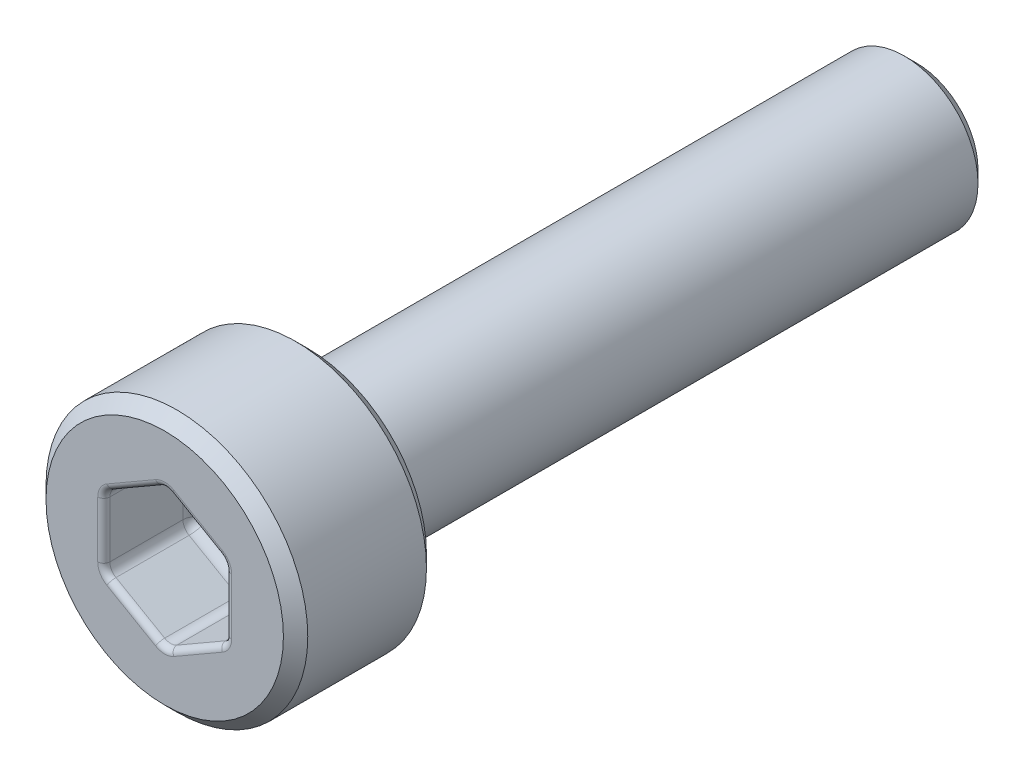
ISO-10303-21;
HEADER;
FILE_DESCRIPTION(('STEP AP214'),'2;1');
FILE_NAME('part.step','',(''),(''),'','','');
FILE_SCHEMA(('AUTOMOTIVE_DESIGN { 1 0 10303 214 1 1 1 1 }'));
ENDSEC;
DATA;
#1=APPLICATION_CONTEXT('core data for automotive mechanical design processes');
#2=APPLICATION_PROTOCOL_DEFINITION('international standard','automotive_design',2000,#1);
#3=PRODUCT_CONTEXT('',#1,'mechanical');
#4=PRODUCT('Part','Part','',(#3));
#5=PRODUCT_RELATED_PRODUCT_CATEGORY('part','',(#4));
#6=PRODUCT_DEFINITION_FORMATION('','',#4);
#7=PRODUCT_DEFINITION_CONTEXT('part definition',#1,'design');
#8=PRODUCT_DEFINITION('design','',#6,#7);
#9=PRODUCT_DEFINITION_SHAPE('','',#8);
#10=(LENGTH_UNIT() NAMED_UNIT(*) SI_UNIT(.MILLI.,.METRE.));
#11=(NAMED_UNIT(*) PLANE_ANGLE_UNIT() SI_UNIT($,.RADIAN.));
#12=(NAMED_UNIT(*) SI_UNIT($,.STERADIAN.) SOLID_ANGLE_UNIT());
#13=UNCERTAINTY_MEASURE_WITH_UNIT(LENGTH_MEASURE(1.E-05),#10,'distance_accuracy_value','');
#14=(GEOMETRIC_REPRESENTATION_CONTEXT(3) GLOBAL_UNCERTAINTY_ASSIGNED_CONTEXT((#13)) GLOBAL_UNIT_ASSIGNED_CONTEXT((#10,
#11,#12)) REPRESENTATION_CONTEXT('',''));
#15=CARTESIAN_POINT('',(0.,0.,0.));
#16=DIRECTION('',(0.,0.,1.));
#17=DIRECTION('',(1.,0.,0.));
#18=AXIS2_PLACEMENT_3D('',#15,#16,#17);
#19=CARTESIAN_POINT('',(0.,0.,2.35));
#20=DIRECTION('',(0.,0.,-1.));
#21=DIRECTION('',(-1.,0.,0.));
#22=AXIS2_PLACEMENT_3D('',#19,#20,#21);
#23=PLANE('',#22);
#24=DIRECTION('',(0.,1.,0.));
#25=VECTOR('',#24,1.);
#26=CARTESIAN_POINT('',(1.1,0.,2.35));
#27=LINE('',#26,#25);
#28=CARTESIAN_POINT('',(1.1,0.4618802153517,2.35));
#29=VERTEX_POINT('',#28);
#30=CARTESIAN_POINT('',(1.1,-0.461880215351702,2.35));
#31=VERTEX_POINT('',#30);
#32=EDGE_CURVE('E268',#29,#31,#27,.F.);
#33=ORIENTED_EDGE('',*,*,#32,.T.);
#34=CARTESIAN_POINT('',(0.8,-0.461880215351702,2.35));
#35=DIRECTION('',(0.,0.,-1.));
#36=DIRECTION('',(-1.,0.,0.));
#37=AXIS2_PLACEMENT_3D('',#34,#35,#36);
#38=CIRCLE('',#37,0.3);
#39=CARTESIAN_POINT('',(0.95,-0.721687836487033,2.35));
#40=VERTEX_POINT('',#39);
#41=EDGE_CURVE('E333',#31,#40,#38,.T.);
#42=ORIENTED_EDGE('',*,*,#41,.T.);
#43=DIRECTION('',(0.866025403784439,0.499999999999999,0.));
#44=VECTOR('',#43,1.);
#45=CARTESIAN_POINT('',(0.549999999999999,-0.952627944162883,2.35));
#46=LINE('',#45,#44);
#47=CARTESIAN_POINT('',(0.149999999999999,-1.18356805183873,2.35));
#48=VERTEX_POINT('',#47);
#49=EDGE_CURVE('E331',#40,#48,#46,.F.);
#50=ORIENTED_EDGE('',*,*,#49,.T.);
#51=CARTESIAN_POINT('',(0.,-0.923760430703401,2.35));
#52=DIRECTION('',(0.,0.,-1.));
#53=DIRECTION('',(-1.,0.,0.));
#54=AXIS2_PLACEMENT_3D('',#51,#52,#53);
#55=CIRCLE('',#54,0.3);
#56=CARTESIAN_POINT('',(-0.150000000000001,-1.18356805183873,2.35));
#57=VERTEX_POINT('',#56);
#58=EDGE_CURVE('E329',#48,#57,#55,.T.);
#59=ORIENTED_EDGE('',*,*,#58,.T.);
#60=DIRECTION('',(0.866025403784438,-0.500000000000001,0.));
#61=VECTOR('',#60,1.);
#62=CARTESIAN_POINT('',(-0.550000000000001,-0.952627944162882,2.35));
#63=LINE('',#62,#61);
#64=CARTESIAN_POINT('',(-0.950000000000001,-0.721687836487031,2.35));
#65=VERTEX_POINT('',#64);
#66=EDGE_CURVE('E327',#57,#65,#63,.F.);
#67=ORIENTED_EDGE('',*,*,#66,.T.);
#68=CARTESIAN_POINT('',(-0.800000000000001,-0.4618802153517,2.35));
#69=DIRECTION('',(0.,0.,-1.));
#70=DIRECTION('',(-1.,0.,0.));
#71=AXIS2_PLACEMENT_3D('',#68,#69,#70);
#72=CIRCLE('',#71,0.3);
#73=CARTESIAN_POINT('',(-1.1,-0.4618802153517,2.35));
#74=VERTEX_POINT('',#73);
#75=EDGE_CURVE('E325',#65,#74,#72,.T.);
#76=ORIENTED_EDGE('',*,*,#75,.T.);
#77=DIRECTION('',(0.,-1.,0.));
#78=VECTOR('',#77,1.);
#79=CARTESIAN_POINT('',(-1.1,0.,2.35));
#80=LINE('',#79,#78);
#81=CARTESIAN_POINT('',(-1.1,0.461880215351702,2.35));
#82=VERTEX_POINT('',#81);
#83=EDGE_CURVE('E323',#74,#82,#80,.F.);
#84=ORIENTED_EDGE('',*,*,#83,.T.);
#85=CARTESIAN_POINT('',(-0.8,0.461880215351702,2.35));
#86=DIRECTION('',(0.,0.,-1.));
#87=DIRECTION('',(-1.,0.,0.));
#88=AXIS2_PLACEMENT_3D('',#85,#86,#87);
#89=CIRCLE('',#88,0.3);
#90=CARTESIAN_POINT('',(-0.95,0.721687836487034,2.35));
#91=VERTEX_POINT('',#90);
#92=EDGE_CURVE('E321',#82,#91,#89,.T.);
#93=ORIENTED_EDGE('',*,*,#92,.T.);
#94=DIRECTION('',(-0.866025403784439,-0.499999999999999,0.));
#95=VECTOR('',#94,1.);
#96=CARTESIAN_POINT('',(-0.549999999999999,0.952627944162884,2.35));
#97=LINE('',#96,#95);
#98=CARTESIAN_POINT('',(-0.149999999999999,1.18356805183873,2.35));
#99=VERTEX_POINT('',#98);
#100=EDGE_CURVE('E319',#91,#99,#97,.F.);
#101=ORIENTED_EDGE('',*,*,#100,.T.);
#102=CARTESIAN_POINT('',(0.,0.923760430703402,2.35));
#103=DIRECTION('',(0.,0.,-1.));
#104=DIRECTION('',(-1.,0.,0.));
#105=AXIS2_PLACEMENT_3D('',#102,#103,#104);
#106=CIRCLE('',#105,0.3);
#107=CARTESIAN_POINT('',(0.150000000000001,1.18356805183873,2.35));
#108=VERTEX_POINT('',#107);
#109=EDGE_CURVE('E317',#99,#108,#106,.T.);
#110=ORIENTED_EDGE('',*,*,#109,.T.);
#111=DIRECTION('',(-0.866025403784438,0.500000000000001,0.));
#112=VECTOR('',#111,1.);
#113=CARTESIAN_POINT('',(0.550000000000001,0.952627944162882,2.35));
#114=LINE('',#113,#112);
#115=CARTESIAN_POINT('',(0.950000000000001,0.721687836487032,2.35));
#116=VERTEX_POINT('',#115);
#117=EDGE_CURVE('E315',#108,#116,#114,.F.);
#118=ORIENTED_EDGE('',*,*,#117,.T.);
#119=CARTESIAN_POINT('',(0.8,0.4618802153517,2.35));
#120=DIRECTION('',(0.,0.,-1.));
#121=DIRECTION('',(-1.,0.,0.));
#122=AXIS2_PLACEMENT_3D('',#119,#120,#121);
#123=CIRCLE('',#122,0.3);
#124=EDGE_CURVE('E313',#116,#29,#123,.T.);
#125=ORIENTED_EDGE('',*,*,#124,.T.);
#126=EDGE_LOOP('',(#33,#42,#50,#59,#67,#76,#84,#93,#101,#110,#118,#125));
#127=FACE_BOUND('',#126,.T.);
#128=CARTESIAN_POINT('',(0.,0.,2.35));
#129=DIRECTION('',(0.,0.,-1.));
#130=DIRECTION('',(-1.,0.,0.));
#131=AXIS2_PLACEMENT_3D('',#128,#129,#130);
#132=CIRCLE('',#131,1.94999999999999);
#133=CARTESIAN_POINT('',(-1.94999999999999,0.,2.35));
#134=VERTEX_POINT('',#133);
#135=EDGE_CURVE('E311',#134,#134,#132,.F.);
#136=ORIENTED_EDGE('',*,*,#135,.T.);
#137=EDGE_LOOP('',(#136));
#138=FACE_BOUND('',#137,.T.);
#139=ADVANCED_FACE('F39',(#127,#138),#23,.F.);
#140=CARTESIAN_POINT('',(0.,0.,21.9198795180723));
#141=DIRECTION('',(0.,0.,1.));
#142=DIRECTION('',(1.,0.,0.));
#143=AXIS2_PLACEMENT_3D('',#140,#141,#142);
#144=CYLINDRICAL_SURFACE('',#143,2.15);
#145=CARTESIAN_POINT('',(0.,0.,2.15));
#146=DIRECTION('',(0.,0.,-1.));
#147=DIRECTION('',(-1.,0.,0.));
#148=AXIS2_PLACEMENT_3D('',#145,#146,#147);
#149=CIRCLE('',#148,2.15);
#150=CARTESIAN_POINT('',(-2.15,0.,2.15));
#151=VERTEX_POINT('',#150);
#152=EDGE_CURVE('E873',#151,#151,#149,.T.);
#153=ORIENTED_EDGE('',*,*,#152,.T.);
#154=EDGE_LOOP('',(#153));
#155=FACE_BOUND('',#154,.T.);
#156=CARTESIAN_POINT('',(0.,0.,0.200000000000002));
#157=DIRECTION('',(0.,0.,1.));
#158=DIRECTION('',(1.,0.,0.));
#159=AXIS2_PLACEMENT_3D('',#156,#157,#158);
#160=CIRCLE('',#159,2.15);
#161=CARTESIAN_POINT('',(2.15,0.,0.200000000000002));
#162=VERTEX_POINT('',#161);
#163=EDGE_CURVE('E878',#162,#162,#160,.T.);
#164=ORIENTED_EDGE('',*,*,#163,.T.);
#165=EDGE_LOOP('',(#164));
#166=FACE_BOUND('',#165,.T.);
#167=ADVANCED_FACE('F432',(#155,#166),#144,.T.);
#168=CARTESIAN_POINT('',(0.,2.15,0.));
#169=DIRECTION('',(0.,0.,1.));
#170=DIRECTION('',(1.,0.,0.));
#171=AXIS2_PLACEMENT_3D('',#168,#169,#170);
#172=PLANE('',#171);
#173=CARTESIAN_POINT('',(0.,0.,0.));
#174=DIRECTION('',(0.,0.,1.));
#175=DIRECTION('',(1.,0.,0.));
#176=AXIS2_PLACEMENT_3D('',#173,#174,#175);
#177=CIRCLE('',#176,1.41);
#178=CARTESIAN_POINT('',(1.41,0.,0.));
#179=VERTEX_POINT('',#178);
#180=EDGE_CURVE('E263',#179,#179,#177,.T.);
#181=ORIENTED_EDGE('',*,*,#180,.T.);
#182=EDGE_LOOP('',(#181));
#183=FACE_BOUND('',#182,.T.);
#184=CARTESIAN_POINT('',(0.,0.,0.));
#185=DIRECTION('',(0.,0.,1.));
#186=DIRECTION('',(1.,0.,0.));
#187=AXIS2_PLACEMENT_3D('',#184,#185,#186);
#188=CIRCLE('',#187,1.95);
#189=CARTESIAN_POINT('',(1.95,0.,0.));
#190=VERTEX_POINT('',#189);
#191=EDGE_CURVE('E871',#190,#190,#188,.F.);
#192=ORIENTED_EDGE('',*,*,#191,.T.);
#193=EDGE_LOOP('',(#192));
#194=FACE_BOUND('',#193,.T.);
#195=ADVANCED_FACE('F438',(#183,#194),#172,.F.);
#196=CARTESIAN_POINT('',(0.,0.,21.9198795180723));
#197=DIRECTION('',(0.,0.,1.));
#198=DIRECTION('',(1.,0.,0.));
#199=AXIS2_PLACEMENT_3D('',#196,#197,#198);
#200=CYLINDRICAL_SURFACE('',#199,1.21);
#201=CARTESIAN_POINT('',(0.,0.,-0.200000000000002));
#202=DIRECTION('',(0.,0.,1.));
#203=DIRECTION('',(1.,0.,0.));
#204=AXIS2_PLACEMENT_3D('',#201,#202,#203);
#205=CIRCLE('',#204,1.21);
#206=CARTESIAN_POINT('',(1.21,0.,-0.200000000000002));
#207=VERTEX_POINT('',#206);
#208=EDGE_CURVE('E266',#207,#207,#205,.F.);
#209=ORIENTED_EDGE('',*,*,#208,.T.);
#210=EDGE_LOOP('',(#209));
#211=FACE_BOUND('',#210,.T.);
#212=CARTESIAN_POINT('',(0.,0.,-9.8));
#213=DIRECTION('',(0.,0.,1.));
#214=DIRECTION('',(1.,0.,0.));
#215=AXIS2_PLACEMENT_3D('',#212,#213,#214);
#216=CIRCLE('',#215,1.21);
#217=CARTESIAN_POINT('',(1.21,0.,-9.8));
#218=VERTEX_POINT('',#217);
#219=EDGE_CURVE('E872',#218,#218,#216,.T.);
#220=ORIENTED_EDGE('',*,*,#219,.T.);
#221=EDGE_LOOP('',(#220));
#222=FACE_BOUND('',#221,.T.);
#223=ADVANCED_FACE('F813',(#211,#222),#200,.T.);
#224=CARTESIAN_POINT('',(0.,1.21,-10.));
#225=DIRECTION('',(0.,0.,1.));
#226=DIRECTION('',(1.,0.,0.));
#227=AXIS2_PLACEMENT_3D('',#224,#225,#226);
#228=PLANE('',#227);
#229=CARTESIAN_POINT('',(0.,0.,-10.));
#230=DIRECTION('',(0.,0.,1.));
#231=DIRECTION('',(1.,0.,0.));
#232=AXIS2_PLACEMENT_3D('',#229,#230,#231);
#233=CIRCLE('',#232,1.01);
#234=CARTESIAN_POINT('',(1.01,0.,-10.));
#235=VERTEX_POINT('',#234);
#236=EDGE_CURVE('E213',#235,#235,#233,.F.);
#237=ORIENTED_EDGE('',*,*,#236,.T.);
#238=EDGE_LOOP('',(#237));
#239=FACE_BOUND('',#238,.T.);
#240=ADVANCED_FACE('F805',(#239),#228,.F.);
#241=CARTESIAN_POINT('',(0.,-1.15470053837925,0.849999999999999));
#242=DIRECTION('',(0.499999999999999,-0.866025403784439,0.));
#243=DIRECTION('',(0.866025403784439,0.499999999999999,0.));
#244=AXIS2_PLACEMENT_3D('',#241,#242,#243);
#245=PLANE('',#244);
#246=DIRECTION('',(0.,0.,1.));
#247=VECTOR('',#246,1.);
#248=CARTESIAN_POINT('',(0.0999999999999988,-1.09696551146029,2.35));
#249=LINE('',#248,#247);
#250=CARTESIAN_POINT('',(0.0999999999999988,-1.09696551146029,1.05));
#251=VERTEX_POINT('',#250);
#252=CARTESIAN_POINT('',(0.0999999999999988,-1.09696551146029,2.25));
#253=VERTEX_POINT('',#252);
#254=EDGE_CURVE('E260',#251,#253,#249,.T.);
#255=ORIENTED_EDGE('',*,*,#254,.T.);
#256=DIRECTION('',(0.866025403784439,0.499999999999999,0.));
#257=VECTOR('',#256,1.);
#258=CARTESIAN_POINT('',(0.,-1.15470053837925,2.25));
#259=LINE('',#258,#257);
#260=CARTESIAN_POINT('',(0.899999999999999,-0.635085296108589,2.25));
#261=VERTEX_POINT('',#260);
#262=EDGE_CURVE('E339',#253,#261,#259,.T.);
#263=ORIENTED_EDGE('',*,*,#262,.T.);
#264=DIRECTION('',(0.,0.,1.));
#265=VECTOR('',#264,1.);
#266=CARTESIAN_POINT('',(0.899999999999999,-0.635085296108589,0.849999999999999));
#267=LINE('',#266,#265);
#268=CARTESIAN_POINT('',(0.899999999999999,-0.635085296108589,1.05));
#269=VERTEX_POINT('',#268);
#270=EDGE_CURVE('E256',#261,#269,#267,.F.);
#271=ORIENTED_EDGE('',*,*,#270,.T.);
#272=DIRECTION('',(0.866025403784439,0.499999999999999,0.));
#273=VECTOR('',#272,1.);
#274=CARTESIAN_POINT('',(0.,-1.15470053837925,1.05));
#275=LINE('',#274,#273);
#276=EDGE_CURVE('E258',#269,#251,#275,.F.);
#277=ORIENTED_EDGE('',*,*,#276,.T.);
#278=EDGE_LOOP('',(#255,#263,#271,#277));
#279=FACE_BOUND('',#278,.T.);
#280=ADVANCED_FACE('F796',(#279),#245,.F.);
#281=CARTESIAN_POINT('',(-1.,-0.577350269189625,0.849999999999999));
#282=DIRECTION('',(-0.500000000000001,-0.866025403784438,0.));
#283=DIRECTION('',(0.866025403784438,-0.500000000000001,0.));
#284=AXIS2_PLACEMENT_3D('',#281,#282,#283);
#285=PLANE('',#284);
#286=DIRECTION('',(0.,0.,1.));
#287=VECTOR('',#286,1.);
#288=CARTESIAN_POINT('',(-0.900000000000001,-0.635085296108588,2.35));
#289=LINE('',#288,#287);
#290=CARTESIAN_POINT('',(-0.900000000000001,-0.635085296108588,1.05));
#291=VERTEX_POINT('',#290);
#292=CARTESIAN_POINT('',(-0.900000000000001,-0.635085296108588,2.25));
#293=VERTEX_POINT('',#292);
#294=EDGE_CURVE('E227',#291,#293,#289,.T.);
#295=ORIENTED_EDGE('',*,*,#294,.T.);
#296=DIRECTION('',(0.866025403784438,-0.500000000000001,0.));
#297=VECTOR('',#296,1.);
#298=CARTESIAN_POINT('',(-1.,-0.577350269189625,2.25));
#299=LINE('',#298,#297);
#300=CARTESIAN_POINT('',(-0.100000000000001,-1.09696551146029,2.25));
#301=VERTEX_POINT('',#300);
#302=EDGE_CURVE('E343',#293,#301,#299,.T.);
#303=ORIENTED_EDGE('',*,*,#302,.T.);
#304=DIRECTION('',(0.,0.,1.));
#305=VECTOR('',#304,1.);
#306=CARTESIAN_POINT('',(-0.100000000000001,-1.09696551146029,0.849999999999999));
#307=LINE('',#306,#305);
#308=CARTESIAN_POINT('',(-0.100000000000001,-1.09696551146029,1.05));
#309=VERTEX_POINT('',#308);
#310=EDGE_CURVE('E219',#301,#309,#307,.F.);
#311=ORIENTED_EDGE('',*,*,#310,.T.);
#312=DIRECTION('',(0.866025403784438,-0.500000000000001,0.));
#313=VECTOR('',#312,1.);
#314=CARTESIAN_POINT('',(-1.,-0.577350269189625,1.05));
#315=LINE('',#314,#313);
#316=EDGE_CURVE('E190',#309,#291,#315,.F.);
#317=ORIENTED_EDGE('',*,*,#316,.T.);
#318=EDGE_LOOP('',(#295,#303,#311,#317));
#319=FACE_BOUND('',#318,.T.);
#320=ADVANCED_FACE('F788',(#319),#285,.F.);
#321=CARTESIAN_POINT('',(-1.,0.577350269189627,0.849999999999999));
#322=DIRECTION('',(-1.,0.,0.));
#323=DIRECTION('',(0.,-1.,0.));
#324=AXIS2_PLACEMENT_3D('',#321,#322,#323);
#325=PLANE('',#324);
#326=DIRECTION('',(0.,0.,1.));
#327=VECTOR('',#326,1.);
#328=CARTESIAN_POINT('',(-1.,0.461880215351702,2.35));
#329=LINE('',#328,#327);
#330=CARTESIAN_POINT('',(-1.,0.461880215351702,1.05));
#331=VERTEX_POINT('',#330);
#332=CARTESIAN_POINT('',(-1.,0.461880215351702,2.25));
#333=VERTEX_POINT('',#332);
#334=EDGE_CURVE('E230',#331,#333,#329,.T.);
#335=ORIENTED_EDGE('',*,*,#334,.T.);
#336=DIRECTION('',(0.,-1.,0.));
#337=VECTOR('',#336,1.);
#338=CARTESIAN_POINT('',(-1.,0.577350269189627,2.25));
#339=LINE('',#338,#337);
#340=CARTESIAN_POINT('',(-1.,-0.4618802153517,2.25));
#341=VERTEX_POINT('',#340);
#342=EDGE_CURVE('E347',#333,#341,#339,.T.);
#343=ORIENTED_EDGE('',*,*,#342,.T.);
#344=DIRECTION('',(0.,0.,1.));
#345=VECTOR('',#344,1.);
#346=CARTESIAN_POINT('',(-1.,-0.4618802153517,0.849999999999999));
#347=LINE('',#346,#345);
#348=CARTESIAN_POINT('',(-1.,-0.4618802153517,1.05));
#349=VERTEX_POINT('',#348);
#350=EDGE_CURVE('E235',#341,#349,#347,.F.);
#351=ORIENTED_EDGE('',*,*,#350,.T.);
#352=DIRECTION('',(0.,-1.,0.));
#353=VECTOR('',#352,1.);
#354=CARTESIAN_POINT('',(-1.,0.577350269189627,1.05));
#355=LINE('',#354,#353);
#356=EDGE_CURVE('E233',#349,#331,#355,.F.);
#357=ORIENTED_EDGE('',*,*,#356,.T.);
#358=EDGE_LOOP('',(#335,#343,#351,#357));
#359=FACE_BOUND('',#358,.T.);
#360=ADVANCED_FACE('F407',(#359),#325,.F.);
#361=CARTESIAN_POINT('',(0.,1.15470053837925,0.849999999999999));
#362=DIRECTION('',(-0.499999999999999,0.866025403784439,0.));
#363=DIRECTION('',(-0.866025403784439,-0.499999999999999,0.));
#364=AXIS2_PLACEMENT_3D('',#361,#362,#363);
#365=PLANE('',#364);
#366=DIRECTION('',(0.,0.,1.));
#367=VECTOR('',#366,1.);
#368=CARTESIAN_POINT('',(-0.0999999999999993,1.09696551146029,2.35));
#369=LINE('',#368,#367);
#370=CARTESIAN_POINT('',(-0.0999999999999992,1.09696551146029,1.05));
#371=VERTEX_POINT('',#370);
#372=CARTESIAN_POINT('',(-0.0999999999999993,1.09696551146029,2.25));
#373=VERTEX_POINT('',#372);
#374=EDGE_CURVE('E241',#371,#373,#369,.T.);
#375=ORIENTED_EDGE('',*,*,#374,.T.);
#376=DIRECTION('',(-0.866025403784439,-0.499999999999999,0.));
#377=VECTOR('',#376,1.);
#378=CARTESIAN_POINT('',(0.,1.15470053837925,2.25));
#379=LINE('',#378,#377);
#380=CARTESIAN_POINT('',(-0.9,0.63508529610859,2.25));
#381=VERTEX_POINT('',#380);
#382=EDGE_CURVE('E351',#373,#381,#379,.T.);
#383=ORIENTED_EDGE('',*,*,#382,.T.);
#384=DIRECTION('',(0.,0.,1.));
#385=VECTOR('',#384,1.);
#386=CARTESIAN_POINT('',(-0.9,0.63508529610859,0.849999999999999));
#387=LINE('',#386,#385);
#388=CARTESIAN_POINT('',(-0.9,0.63508529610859,1.05));
#389=VERTEX_POINT('',#388);
#390=EDGE_CURVE('E237',#381,#389,#387,.F.);
#391=ORIENTED_EDGE('',*,*,#390,.T.);
#392=DIRECTION('',(-0.866025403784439,-0.499999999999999,0.));
#393=VECTOR('',#392,1.);
#394=CARTESIAN_POINT('',(0.,1.15470053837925,1.05));
#395=LINE('',#394,#393);
#396=EDGE_CURVE('E239',#389,#371,#395,.F.);
#397=ORIENTED_EDGE('',*,*,#396,.T.);
#398=EDGE_LOOP('',(#375,#383,#391,#397));
#399=FACE_BOUND('',#398,.T.);
#400=ADVANCED_FACE('F771',(#399),#365,.F.);
#401=CARTESIAN_POINT('',(1.,0.577350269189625,0.849999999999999));
#402=DIRECTION('',(0.500000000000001,0.866025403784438,0.));
#403=DIRECTION('',(-0.866025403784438,0.500000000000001,0.));
#404=AXIS2_PLACEMENT_3D('',#401,#402,#403);
#405=PLANE('',#404);
#406=DIRECTION('',(0.,0.,1.));
#407=VECTOR('',#406,1.);
#408=CARTESIAN_POINT('',(0.9,0.635085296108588,2.35));
#409=LINE('',#408,#407);
#410=CARTESIAN_POINT('',(0.9,0.635085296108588,1.05));
#411=VERTEX_POINT('',#410);
#412=CARTESIAN_POINT('',(0.9,0.635085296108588,2.25));
#413=VERTEX_POINT('',#412);
#414=EDGE_CURVE('E248',#411,#413,#409,.T.);
#415=ORIENTED_EDGE('',*,*,#414,.T.);
#416=DIRECTION('',(-0.866025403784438,0.500000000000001,0.));
#417=VECTOR('',#416,1.);
#418=CARTESIAN_POINT('',(1.,0.577350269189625,2.25));
#419=LINE('',#418,#417);
#420=CARTESIAN_POINT('',(0.100000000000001,1.09696551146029,2.25));
#421=VERTEX_POINT('',#420);
#422=EDGE_CURVE('E355',#413,#421,#419,.T.);
#423=ORIENTED_EDGE('',*,*,#422,.T.);
#424=DIRECTION('',(0.,0.,1.));
#425=VECTOR('',#424,1.);
#426=CARTESIAN_POINT('',(0.100000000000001,1.09696551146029,0.849999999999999));
#427=LINE('',#426,#425);
#428=CARTESIAN_POINT('',(0.100000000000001,1.09696551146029,1.05));
#429=VERTEX_POINT('',#428);
#430=EDGE_CURVE('E244',#421,#429,#427,.F.);
#431=ORIENTED_EDGE('',*,*,#430,.T.);
#432=DIRECTION('',(-0.866025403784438,0.500000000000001,0.));
#433=VECTOR('',#432,1.);
#434=CARTESIAN_POINT('',(1.,0.577350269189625,1.05));
#435=LINE('',#434,#433);
#436=EDGE_CURVE('E246',#429,#411,#435,.F.);
#437=ORIENTED_EDGE('',*,*,#436,.T.);
#438=EDGE_LOOP('',(#415,#423,#431,#437));
#439=FACE_BOUND('',#438,.T.);
#440=ADVANCED_FACE('F763',(#439),#405,.F.);
#441=CARTESIAN_POINT('',(1.,-0.577350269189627,0.849999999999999));
#442=DIRECTION('',(1.,0.,0.));
#443=DIRECTION('',(0.,1.,0.));
#444=AXIS2_PLACEMENT_3D('',#441,#442,#443);
#445=PLANE('',#444);
#446=DIRECTION('',(0.,0.,1.));
#447=VECTOR('',#446,1.);
#448=CARTESIAN_POINT('',(1.,-0.461880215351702,2.35));
#449=LINE('',#448,#447);
#450=CARTESIAN_POINT('',(1.,-0.461880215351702,1.05));
#451=VERTEX_POINT('',#450);
#452=CARTESIAN_POINT('',(1.,-0.461880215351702,2.25));
#453=VERTEX_POINT('',#452);
#454=EDGE_CURVE('E254',#451,#453,#449,.T.);
#455=ORIENTED_EDGE('',*,*,#454,.T.);
#456=DIRECTION('',(0.,1.,0.));
#457=VECTOR('',#456,1.);
#458=CARTESIAN_POINT('',(1.,-0.577350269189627,2.25));
#459=LINE('',#458,#457);
#460=CARTESIAN_POINT('',(1.,0.4618802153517,2.25));
#461=VERTEX_POINT('',#460);
#462=EDGE_CURVE('E11',#453,#461,#459,.T.);
#463=ORIENTED_EDGE('',*,*,#462,.T.);
#464=DIRECTION('',(0.,0.,1.));
#465=VECTOR('',#464,1.);
#466=CARTESIAN_POINT('',(1.,0.4618802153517,0.849999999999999));
#467=LINE('',#466,#465);
#468=CARTESIAN_POINT('',(1.,0.4618802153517,1.05));
#469=VERTEX_POINT('',#468);
#470=EDGE_CURVE('E250',#461,#469,#467,.F.);
#471=ORIENTED_EDGE('',*,*,#470,.T.);
#472=DIRECTION('',(0.,1.,0.));
#473=VECTOR('',#472,1.);
#474=CARTESIAN_POINT('',(1.,-0.577350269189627,1.05));
#475=LINE('',#474,#473);
#476=EDGE_CURVE('E252',#469,#451,#475,.F.);
#477=ORIENTED_EDGE('',*,*,#476,.T.);
#478=EDGE_LOOP('',(#455,#463,#471,#477));
#479=FACE_BOUND('',#478,.T.);
#480=ADVANCED_FACE('F755',(#479),#445,.F.);
#481=CARTESIAN_POINT('',(0.,0.,0.849999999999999));
#482=DIRECTION('',(0.,0.,1.));
#483=DIRECTION('',(1.,0.,0.));
#484=AXIS2_PLACEMENT_3D('',#481,#482,#483);
#485=PLANE('',#484);
#486=DIRECTION('',(0.,-1.,0.));
#487=VECTOR('',#486,1.);
#488=CARTESIAN_POINT('',(-0.8,0.,0.849999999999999));
#489=LINE('',#488,#487);
#490=CARTESIAN_POINT('',(-0.8,0.461880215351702,0.849999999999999));
#491=VERTEX_POINT('',#490);
#492=CARTESIAN_POINT('',(-0.800000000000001,-0.4618802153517,0.849999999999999));
#493=VERTEX_POINT('',#492);
#494=EDGE_CURVE('E217',#491,#493,#489,.T.);
#495=ORIENTED_EDGE('',*,*,#494,.T.);
#496=DIRECTION('',(0.866025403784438,-0.500000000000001,0.));
#497=VECTOR('',#496,1.);
#498=CARTESIAN_POINT('',(-0.400000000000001,-0.692820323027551,0.849999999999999));
#499=LINE('',#498,#497);
#500=CARTESIAN_POINT('',(0.,-0.923760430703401,0.849999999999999));
#501=VERTEX_POINT('',#500);
#502=EDGE_CURVE('E188',#493,#501,#499,.T.);
#503=ORIENTED_EDGE('',*,*,#502,.T.);
#504=DIRECTION('',(0.866025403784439,0.499999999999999,0.));
#505=VECTOR('',#504,1.);
#506=CARTESIAN_POINT('',(0.399999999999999,-0.692820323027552,0.849999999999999));
#507=LINE('',#506,#505);
#508=CARTESIAN_POINT('',(0.8,-0.461880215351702,0.849999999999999));
#509=VERTEX_POINT('',#508);
#510=EDGE_CURVE('E206',#501,#509,#507,.T.);
#511=ORIENTED_EDGE('',*,*,#510,.T.);
#512=DIRECTION('',(0.,1.,0.));
#513=VECTOR('',#512,1.);
#514=CARTESIAN_POINT('',(0.8,0.,0.849999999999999));
#515=LINE('',#514,#513);
#516=CARTESIAN_POINT('',(0.8,0.4618802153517,0.849999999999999));
#517=VERTEX_POINT('',#516);
#518=EDGE_CURVE('E212',#509,#517,#515,.T.);
#519=ORIENTED_EDGE('',*,*,#518,.T.);
#520=DIRECTION('',(-0.866025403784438,0.500000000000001,0.));
#521=VECTOR('',#520,1.);
#522=CARTESIAN_POINT('',(0.400000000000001,0.692820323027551,0.849999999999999));
#523=LINE('',#522,#521);
#524=CARTESIAN_POINT('',(0.,0.923760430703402,0.849999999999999));
#525=VERTEX_POINT('',#524);
#526=EDGE_CURVE('E885',#517,#525,#523,.T.);
#527=ORIENTED_EDGE('',*,*,#526,.T.);
#528=DIRECTION('',(-0.866025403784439,-0.499999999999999,0.));
#529=VECTOR('',#528,1.);
#530=CARTESIAN_POINT('',(-0.4,0.692820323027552,0.849999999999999));
#531=LINE('',#530,#529);
#532=EDGE_CURVE('E222',#525,#491,#531,.T.);
#533=ORIENTED_EDGE('',*,*,#532,.T.);
#534=EDGE_LOOP('',(#495,#503,#511,#519,#527,#533));
#535=FACE_BOUND('',#534,.T.);
#536=ADVANCED_FACE('F215',(#535),#485,.T.);
#537=CARTESIAN_POINT('',(0.,0.,2.35));
#538=DIRECTION('',(0.,0.,-1.));
#539=DIRECTION('',(-1.,0.,0.));
#540=AXIS2_PLACEMENT_3D('',#537,#538,#539);
#541=CONICAL_SURFACE('',#540,1.95,0.785398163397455);
#542=ORIENTED_EDGE('',*,*,#152,.F.);
#543=EDGE_LOOP('',(#542));
#544=FACE_BOUND('',#543,.T.);
#545=ORIENTED_EDGE('',*,*,#135,.F.);
#546=EDGE_LOOP('',(#545));
#547=FACE_BOUND('',#546,.T.);
#548=ADVANCED_FACE('F444',(#544,#547),#541,.T.);
#549=CARTESIAN_POINT('',(0.,0.,0.200000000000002));
#550=DIRECTION('',(0.,0.,1.));
#551=DIRECTION('',(1.,0.,0.));
#552=AXIS2_PLACEMENT_3D('',#549,#550,#551);
#553=CONICAL_SURFACE('',#552,2.15,0.78539816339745);
#554=ORIENTED_EDGE('',*,*,#191,.F.);
#555=EDGE_LOOP('',(#554));
#556=FACE_BOUND('',#555,.T.);
#557=ORIENTED_EDGE('',*,*,#163,.F.);
#558=EDGE_LOOP('',(#557));
#559=FACE_BOUND('',#558,.T.);
#560=ADVANCED_FACE('F447',(#556,#559),#553,.T.);
#561=CARTESIAN_POINT('',(0.,0.,-9.8));
#562=DIRECTION('',(0.,0.,1.));
#563=DIRECTION('',(1.,0.,0.));
#564=AXIS2_PLACEMENT_3D('',#561,#562,#563);
#565=CONICAL_SURFACE('',#564,1.21,0.785398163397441);
#566=ORIENTED_EDGE('',*,*,#236,.F.);
#567=EDGE_LOOP('',(#566));
#568=FACE_BOUND('',#567,.T.);
#569=ORIENTED_EDGE('',*,*,#219,.F.);
#570=EDGE_LOOP('',(#569));
#571=FACE_BOUND('',#570,.T.);
#572=ADVANCED_FACE('F451',(#568,#571),#565,.T.);
#573=CARTESIAN_POINT('',(0.,0.923760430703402,0.849999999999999));
#574=DIRECTION('',(0.,0.,-1.));
#575=DIRECTION('',(-1.,0.,0.));
#576=AXIS2_PLACEMENT_3D('',#573,#574,#575);
#577=CYLINDRICAL_SURFACE('',#576,0.2);
#578=ORIENTED_EDGE('',*,*,#430,.F.);
#579=CARTESIAN_POINT('',(0.,0.923760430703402,2.25));
#580=DIRECTION('',(0.,0.,-1.));
#581=DIRECTION('',(-1.,0.,0.));
#582=AXIS2_PLACEMENT_3D('',#579,#580,#581);
#583=CIRCLE('',#582,0.2);
#584=EDGE_CURVE('E353',#421,#373,#583,.F.);
#585=ORIENTED_EDGE('',*,*,#584,.T.);
#586=ORIENTED_EDGE('',*,*,#374,.F.);
#587=CARTESIAN_POINT('',(0.,0.923760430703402,1.05));
#588=DIRECTION('',(0.,0.,1.));
#589=DIRECTION('',(1.,0.,0.));
#590=AXIS2_PLACEMENT_3D('',#587,#588,#589);
#591=CIRCLE('',#590,0.2);
#592=EDGE_CURVE('E308',#429,#371,#591,.T.);
#593=ORIENTED_EDGE('',*,*,#592,.F.);
#594=EDGE_LOOP('',(#578,#585,#586,#593));
#595=FACE_BOUND('',#594,.T.);
#596=ADVANCED_FACE('F455',(#595),#577,.F.);
#597=CARTESIAN_POINT('',(0.400000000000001,0.692820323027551,1.05));
#598=DIRECTION('',(-0.866025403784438,0.500000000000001,0.));
#599=DIRECTION('',(-0.500000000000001,-0.866025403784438,0.));
#600=AXIS2_PLACEMENT_3D('',#597,#598,#599);
#601=CYLINDRICAL_SURFACE('',#600,0.2);
#602=CARTESIAN_POINT('',(0.8,0.4618802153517,1.05));
#603=DIRECTION('',(-0.866025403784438,0.500000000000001,0.));
#604=DIRECTION('',(-0.500000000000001,-0.866025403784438,0.));
#605=AXIS2_PLACEMENT_3D('',#602,#603,#604);
#606=CIRCLE('',#605,0.2);
#607=EDGE_CURVE('E302',#411,#517,#606,.T.);
#608=ORIENTED_EDGE('',*,*,#607,.F.);
#609=ORIENTED_EDGE('',*,*,#436,.F.);
#610=CARTESIAN_POINT('',(0.,0.923760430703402,1.05));
#611=DIRECTION('',(0.866025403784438,-0.500000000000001,0.));
#612=DIRECTION('',(0.500000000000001,0.866025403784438,0.));
#613=AXIS2_PLACEMENT_3D('',#610,#611,#612);
#614=CIRCLE('',#613,0.2);
#615=EDGE_CURVE('E305',#525,#429,#614,.T.);
#616=ORIENTED_EDGE('',*,*,#615,.F.);
#617=ORIENTED_EDGE('',*,*,#526,.F.);
#618=EDGE_LOOP('',(#608,#609,#616,#617));
#619=FACE_BOUND('',#618,.T.);
#620=ADVANCED_FACE('F716',(#619),#601,.F.);
#621=CARTESIAN_POINT('',(0.8,0.4618802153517,0.849999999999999));
#622=DIRECTION('',(0.,0.,-1.));
#623=DIRECTION('',(-1.,0.,0.));
#624=AXIS2_PLACEMENT_3D('',#621,#622,#623);
#625=CYLINDRICAL_SURFACE('',#624,0.2);
#626=ORIENTED_EDGE('',*,*,#470,.F.);
#627=CARTESIAN_POINT('',(0.8,0.4618802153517,2.25));
#628=DIRECTION('',(0.,0.,-1.));
#629=DIRECTION('',(-1.,0.,0.));
#630=AXIS2_PLACEMENT_3D('',#627,#628,#629);
#631=CIRCLE('',#630,0.2);
#632=EDGE_CURVE('E48',#461,#413,#631,.F.);
#633=ORIENTED_EDGE('',*,*,#632,.T.);
#634=ORIENTED_EDGE('',*,*,#414,.F.);
#635=CARTESIAN_POINT('',(0.8,0.4618802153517,1.05));
#636=DIRECTION('',(0.,0.,1.));
#637=DIRECTION('',(1.,0.,0.));
#638=AXIS2_PLACEMENT_3D('',#635,#636,#637);
#639=CIRCLE('',#638,0.2);
#640=EDGE_CURVE('E299',#469,#411,#639,.T.);
#641=ORIENTED_EDGE('',*,*,#640,.F.);
#642=EDGE_LOOP('',(#626,#633,#634,#641));
#643=FACE_BOUND('',#642,.T.);
#644=ADVANCED_FACE('F707',(#643),#625,.F.);
#645=CARTESIAN_POINT('',(0.,0.923760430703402,1.05));
#646=DIRECTION('',(0.,0.,1.));
#647=DIRECTION('',(1.,0.,0.));
#648=AXIS2_PLACEMENT_3D('',#645,#646,#647);
#649=SPHERICAL_SURFACE('',#648,0.2);
#650=ORIENTED_EDGE('',*,*,#615,.T.);
#651=ORIENTED_EDGE('',*,*,#592,.T.);
#652=CARTESIAN_POINT('',(0.,0.923760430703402,1.05));
#653=DIRECTION('',(-0.866025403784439,-0.499999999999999,0.));
#654=DIRECTION('',(0.499999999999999,-0.866025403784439,0.));
#655=AXIS2_PLACEMENT_3D('',#652,#653,#654);
#656=CIRCLE('',#655,0.2);
#657=EDGE_CURVE('E296',#525,#371,#656,.F.);
#658=ORIENTED_EDGE('',*,*,#657,.F.);
#659=EDGE_LOOP('',(#650,#651,#658));
#660=FACE_BOUND('',#659,.T.);
#661=ADVANCED_FACE('F698',(#660),#649,.F.);
#662=CARTESIAN_POINT('',(0.8,0.4618802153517,1.05));
#663=DIRECTION('',(0.,0.,1.));
#664=DIRECTION('',(1.,0.,0.));
#665=AXIS2_PLACEMENT_3D('',#662,#663,#664);
#666=SPHERICAL_SURFACE('',#665,0.2);
#667=ORIENTED_EDGE('',*,*,#640,.T.);
#668=ORIENTED_EDGE('',*,*,#607,.T.);
#669=CARTESIAN_POINT('',(0.8,0.4618802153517,1.05));
#670=DIRECTION('',(0.,-1.,0.));
#671=DIRECTION('',(1.,0.,0.));
#672=AXIS2_PLACEMENT_3D('',#669,#670,#671);
#673=CIRCLE('',#672,0.2);
#674=EDGE_CURVE('E293',#469,#517,#673,.F.);
#675=ORIENTED_EDGE('',*,*,#674,.F.);
#676=EDGE_LOOP('',(#667,#668,#675));
#677=FACE_BOUND('',#676,.T.);
#678=ADVANCED_FACE('F690',(#677),#666,.F.);
#679=CARTESIAN_POINT('',(-0.8,0.461880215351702,0.849999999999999));
#680=DIRECTION('',(0.,0.,-1.));
#681=DIRECTION('',(-1.,0.,0.));
#682=AXIS2_PLACEMENT_3D('',#679,#680,#681);
#683=CYLINDRICAL_SURFACE('',#682,0.2);
#684=ORIENTED_EDGE('',*,*,#390,.F.);
#685=CARTESIAN_POINT('',(-0.8,0.461880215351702,2.25));
#686=DIRECTION('',(0.,0.,-1.));
#687=DIRECTION('',(-1.,0.,0.));
#688=AXIS2_PLACEMENT_3D('',#685,#686,#687);
#689=CIRCLE('',#688,0.2);
#690=EDGE_CURVE('E349',#381,#333,#689,.F.);
#691=ORIENTED_EDGE('',*,*,#690,.T.);
#692=ORIENTED_EDGE('',*,*,#334,.F.);
#693=CARTESIAN_POINT('',(-0.8,0.461880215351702,1.05));
#694=DIRECTION('',(0.,0.,1.));
#695=DIRECTION('',(1.,0.,0.));
#696=AXIS2_PLACEMENT_3D('',#693,#694,#695);
#697=CIRCLE('',#696,0.2);
#698=EDGE_CURVE('E290',#389,#331,#697,.T.);
#699=ORIENTED_EDGE('',*,*,#698,.F.);
#700=EDGE_LOOP('',(#684,#691,#692,#699));
#701=FACE_BOUND('',#700,.T.);
#702=ADVANCED_FACE('F404',(#701),#683,.F.);
#703=CARTESIAN_POINT('',(-0.4,0.692820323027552,1.05));
#704=DIRECTION('',(-0.866025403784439,-0.499999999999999,0.));
#705=DIRECTION('',(0.499999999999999,-0.866025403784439,0.));
#706=AXIS2_PLACEMENT_3D('',#703,#704,#705);
#707=CYLINDRICAL_SURFACE('',#706,0.2);
#708=ORIENTED_EDGE('',*,*,#657,.T.);
#709=ORIENTED_EDGE('',*,*,#396,.F.);
#710=CARTESIAN_POINT('',(-0.8,0.461880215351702,1.05));
#711=DIRECTION('',(0.866025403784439,0.499999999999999,0.));
#712=DIRECTION('',(-0.499999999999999,0.866025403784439,0.));
#713=AXIS2_PLACEMENT_3D('',#710,#711,#712);
#714=CIRCLE('',#713,0.2);
#715=EDGE_CURVE('E287',#491,#389,#714,.T.);
#716=ORIENTED_EDGE('',*,*,#715,.F.);
#717=ORIENTED_EDGE('',*,*,#532,.F.);
#718=EDGE_LOOP('',(#708,#709,#716,#717));
#719=FACE_BOUND('',#718,.T.);
#720=ADVANCED_FACE('F673',(#719),#707,.F.);
#721=CARTESIAN_POINT('',(0.8,0.,1.05));
#722=DIRECTION('',(0.,1.,0.));
#723=DIRECTION('',(-1.,0.,0.));
#724=AXIS2_PLACEMENT_3D('',#721,#722,#723);
#725=CYLINDRICAL_SURFACE('',#724,0.2);
#726=ORIENTED_EDGE('',*,*,#674,.T.);
#727=ORIENTED_EDGE('',*,*,#518,.F.);
#728=CARTESIAN_POINT('',(0.8,-0.461880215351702,1.05));
#729=DIRECTION('',(0.,1.,0.));
#730=DIRECTION('',(-1.,0.,0.));
#731=AXIS2_PLACEMENT_3D('',#728,#729,#730);
#732=CIRCLE('',#731,0.2);
#733=EDGE_CURVE('E284',#451,#509,#732,.T.);
#734=ORIENTED_EDGE('',*,*,#733,.F.);
#735=ORIENTED_EDGE('',*,*,#476,.F.);
#736=EDGE_LOOP('',(#726,#727,#734,#735));
#737=FACE_BOUND('',#736,.T.);
#738=ADVANCED_FACE('F664',(#737),#725,.F.);
#739=CARTESIAN_POINT('',(0.8,-0.461880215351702,0.849999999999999));
#740=DIRECTION('',(0.,0.,-1.));
#741=DIRECTION('',(-1.,0.,0.));
#742=AXIS2_PLACEMENT_3D('',#739,#740,#741);
#743=CYLINDRICAL_SURFACE('',#742,0.2);
#744=ORIENTED_EDGE('',*,*,#270,.F.);
#745=CARTESIAN_POINT('',(0.8,-0.461880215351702,2.25));
#746=DIRECTION('',(0.,0.,-1.));
#747=DIRECTION('',(-1.,0.,0.));
#748=AXIS2_PLACEMENT_3D('',#745,#746,#747);
#749=CIRCLE('',#748,0.2);
#750=EDGE_CURVE('E336',#261,#453,#749,.F.);
#751=ORIENTED_EDGE('',*,*,#750,.T.);
#752=ORIENTED_EDGE('',*,*,#454,.F.);
#753=CARTESIAN_POINT('',(0.8,-0.461880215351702,1.05));
#754=DIRECTION('',(0.,0.,1.));
#755=DIRECTION('',(1.,0.,0.));
#756=AXIS2_PLACEMENT_3D('',#753,#754,#755);
#757=CIRCLE('',#756,0.2);
#758=EDGE_CURVE('E281',#269,#451,#757,.T.);
#759=ORIENTED_EDGE('',*,*,#758,.F.);
#760=EDGE_LOOP('',(#744,#751,#752,#759));
#761=FACE_BOUND('',#760,.T.);
#762=ADVANCED_FACE('F655',(#761),#743,.F.);
#763=CARTESIAN_POINT('',(-0.8,0.461880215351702,1.05));
#764=DIRECTION('',(0.,0.,1.));
#765=DIRECTION('',(1.,0.,0.));
#766=AXIS2_PLACEMENT_3D('',#763,#764,#765);
#767=SPHERICAL_SURFACE('',#766,0.2);
#768=ORIENTED_EDGE('',*,*,#715,.T.);
#769=ORIENTED_EDGE('',*,*,#698,.T.);
#770=CARTESIAN_POINT('',(-0.8,0.461880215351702,1.05));
#771=DIRECTION('',(0.,-1.,0.));
#772=DIRECTION('',(1.,0.,0.));
#773=AXIS2_PLACEMENT_3D('',#770,#771,#772);
#774=CIRCLE('',#773,0.2);
#775=EDGE_CURVE('E278',#491,#331,#774,.F.);
#776=ORIENTED_EDGE('',*,*,#775,.F.);
#777=EDGE_LOOP('',(#768,#769,#776));
#778=FACE_BOUND('',#777,.T.);
#779=ADVANCED_FACE('F646',(#778),#767,.F.);
#780=CARTESIAN_POINT('',(0.8,-0.461880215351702,1.05));
#781=DIRECTION('',(0.,0.,1.));
#782=DIRECTION('',(1.,0.,0.));
#783=AXIS2_PLACEMENT_3D('',#780,#781,#782);
#784=SPHERICAL_SURFACE('',#783,0.2);
#785=ORIENTED_EDGE('',*,*,#758,.T.);
#786=ORIENTED_EDGE('',*,*,#733,.T.);
#787=CARTESIAN_POINT('',(0.8,-0.461880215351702,1.05));
#788=DIRECTION('',(-0.866025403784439,-0.499999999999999,0.));
#789=DIRECTION('',(0.499999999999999,-0.866025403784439,0.));
#790=AXIS2_PLACEMENT_3D('',#787,#788,#789);
#791=CIRCLE('',#790,0.2);
#792=EDGE_CURVE('E209',#269,#509,#791,.F.);
#793=ORIENTED_EDGE('',*,*,#792,.F.);
#794=EDGE_LOOP('',(#785,#786,#793));
#795=FACE_BOUND('',#794,.T.);
#796=ADVANCED_FACE('F638',(#795),#784,.F.);
#797=CARTESIAN_POINT('',(-0.800000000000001,-0.4618802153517,0.849999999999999));
#798=DIRECTION('',(0.,0.,-1.));
#799=DIRECTION('',(-1.,0.,0.));
#800=AXIS2_PLACEMENT_3D('',#797,#798,#799);
#801=CYLINDRICAL_SURFACE('',#800,0.2);
#802=ORIENTED_EDGE('',*,*,#350,.F.);
#803=CARTESIAN_POINT('',(-0.800000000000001,-0.4618802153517,2.25));
#804=DIRECTION('',(0.,0.,-1.));
#805=DIRECTION('',(-1.,0.,0.));
#806=AXIS2_PLACEMENT_3D('',#803,#804,#805);
#807=CIRCLE('',#806,0.2);
#808=EDGE_CURVE('E345',#341,#293,#807,.F.);
#809=ORIENTED_EDGE('',*,*,#808,.T.);
#810=ORIENTED_EDGE('',*,*,#294,.F.);
#811=CARTESIAN_POINT('',(-0.800000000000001,-0.4618802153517,1.05));
#812=DIRECTION('',(0.,0.,1.));
#813=DIRECTION('',(1.,0.,0.));
#814=AXIS2_PLACEMENT_3D('',#811,#812,#813);
#815=CIRCLE('',#814,0.2);
#816=EDGE_CURVE('E274',#349,#291,#815,.T.);
#817=ORIENTED_EDGE('',*,*,#816,.F.);
#818=EDGE_LOOP('',(#802,#809,#810,#817));
#819=FACE_BOUND('',#818,.T.);
#820=ADVANCED_FACE('F417',(#819),#801,.F.);
#821=CARTESIAN_POINT('',(-0.8,0.,1.05));
#822=DIRECTION('',(0.,-1.,0.));
#823=DIRECTION('',(1.,0.,0.));
#824=AXIS2_PLACEMENT_3D('',#821,#822,#823);
#825=CYLINDRICAL_SURFACE('',#824,0.2);
#826=ORIENTED_EDGE('',*,*,#775,.T.);
#827=ORIENTED_EDGE('',*,*,#356,.F.);
#828=CARTESIAN_POINT('',(-0.800000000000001,-0.4618802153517,1.05));
#829=DIRECTION('',(0.,1.,0.));
#830=DIRECTION('',(-1.,0.,0.));
#831=AXIS2_PLACEMENT_3D('',#828,#829,#830);
#832=CIRCLE('',#831,0.2);
#833=EDGE_CURVE('E203',#493,#349,#832,.T.);
#834=ORIENTED_EDGE('',*,*,#833,.F.);
#835=ORIENTED_EDGE('',*,*,#494,.F.);
#836=EDGE_LOOP('',(#826,#827,#834,#835));
#837=FACE_BOUND('',#836,.T.);
#838=ADVANCED_FACE('F412',(#837),#825,.F.);
#839=CARTESIAN_POINT('',(0.399999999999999,-0.692820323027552,1.05));
#840=DIRECTION('',(0.866025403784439,0.499999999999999,0.));
#841=DIRECTION('',(-0.499999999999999,0.866025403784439,0.));
#842=AXIS2_PLACEMENT_3D('',#839,#840,#841);
#843=CYLINDRICAL_SURFACE('',#842,0.2);
#844=ORIENTED_EDGE('',*,*,#792,.T.);
#845=ORIENTED_EDGE('',*,*,#510,.F.);
#846=CARTESIAN_POINT('',(0.,-0.923760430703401,1.05));
#847=DIRECTION('',(0.866025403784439,0.499999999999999,0.));
#848=DIRECTION('',(-0.499999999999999,0.866025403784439,0.));
#849=AXIS2_PLACEMENT_3D('',#846,#847,#848);
#850=CIRCLE('',#849,0.2);
#851=EDGE_CURVE('E196',#251,#501,#850,.T.);
#852=ORIENTED_EDGE('',*,*,#851,.F.);
#853=ORIENTED_EDGE('',*,*,#276,.F.);
#854=EDGE_LOOP('',(#844,#845,#852,#853));
#855=FACE_BOUND('',#854,.T.);
#856=ADVANCED_FACE('F207',(#855),#843,.F.);
#857=CARTESIAN_POINT('',(0.,-0.923760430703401,0.849999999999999));
#858=DIRECTION('',(0.,0.,-1.));
#859=DIRECTION('',(-1.,0.,0.));
#860=AXIS2_PLACEMENT_3D('',#857,#858,#859);
#861=CYLINDRICAL_SURFACE('',#860,0.2);
#862=ORIENTED_EDGE('',*,*,#310,.F.);
#863=CARTESIAN_POINT('',(0.,-0.923760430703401,2.25));
#864=DIRECTION('',(0.,0.,-1.));
#865=DIRECTION('',(-1.,0.,0.));
#866=AXIS2_PLACEMENT_3D('',#863,#864,#865);
#867=CIRCLE('',#866,0.2);
#868=EDGE_CURVE('E341',#301,#253,#867,.F.);
#869=ORIENTED_EDGE('',*,*,#868,.T.);
#870=ORIENTED_EDGE('',*,*,#254,.F.);
#871=CARTESIAN_POINT('',(0.,-0.923760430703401,1.05));
#872=DIRECTION('',(0.,0.,1.));
#873=DIRECTION('',(1.,0.,0.));
#874=AXIS2_PLACEMENT_3D('',#871,#872,#873);
#875=CIRCLE('',#874,0.2);
#876=EDGE_CURVE('E200',#309,#251,#875,.T.);
#877=ORIENTED_EDGE('',*,*,#876,.F.);
#878=EDGE_LOOP('',(#862,#869,#870,#877));
#879=FACE_BOUND('',#878,.T.);
#880=ADVANCED_FACE('F422',(#879),#861,.F.);
#881=CARTESIAN_POINT('',(-0.800000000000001,-0.4618802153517,1.05));
#882=DIRECTION('',(0.,0.,1.));
#883=DIRECTION('',(1.,0.,0.));
#884=AXIS2_PLACEMENT_3D('',#881,#882,#883);
#885=SPHERICAL_SURFACE('',#884,0.2);
#886=ORIENTED_EDGE('',*,*,#833,.T.);
#887=ORIENTED_EDGE('',*,*,#816,.T.);
#888=CARTESIAN_POINT('',(-0.800000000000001,-0.4618802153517,1.05));
#889=DIRECTION('',(0.866025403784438,-0.500000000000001,0.));
#890=DIRECTION('',(0.500000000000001,0.866025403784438,0.));
#891=AXIS2_PLACEMENT_3D('',#888,#889,#890);
#892=CIRCLE('',#891,0.2);
#893=EDGE_CURVE('E193',#493,#291,#892,.F.);
#894=ORIENTED_EDGE('',*,*,#893,.F.);
#895=EDGE_LOOP('',(#886,#887,#894));
#896=FACE_BOUND('',#895,.T.);
#897=ADVANCED_FACE('F420',(#896),#885,.F.);
#898=CARTESIAN_POINT('',(0.,-0.923760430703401,1.05));
#899=DIRECTION('',(0.,0.,1.));
#900=DIRECTION('',(1.,0.,0.));
#901=AXIS2_PLACEMENT_3D('',#898,#899,#900);
#902=SPHERICAL_SURFACE('',#901,0.2);
#903=ORIENTED_EDGE('',*,*,#876,.T.);
#904=ORIENTED_EDGE('',*,*,#851,.T.);
#905=CARTESIAN_POINT('',(0.,-0.923760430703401,1.05));
#906=DIRECTION('',(-0.866025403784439,0.5,0.));
#907=DIRECTION('',(-0.5,-0.866025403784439,0.));
#908=AXIS2_PLACEMENT_3D('',#905,#906,#907);
#909=CIRCLE('',#908,0.2);
#910=EDGE_CURVE('E184',#309,#501,#909,.F.);
#911=ORIENTED_EDGE('',*,*,#910,.F.);
#912=EDGE_LOOP('',(#903,#904,#911));
#913=FACE_BOUND('',#912,.T.);
#914=ADVANCED_FACE('F198',(#913),#902,.F.);
#915=CARTESIAN_POINT('',(-0.400000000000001,-0.692820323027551,1.05));
#916=DIRECTION('',(0.866025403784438,-0.500000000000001,0.));
#917=DIRECTION('',(0.500000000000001,0.866025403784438,0.));
#918=AXIS2_PLACEMENT_3D('',#915,#916,#917);
#919=CYLINDRICAL_SURFACE('',#918,0.2);
#920=ORIENTED_EDGE('',*,*,#893,.T.);
#921=ORIENTED_EDGE('',*,*,#316,.F.);
#922=ORIENTED_EDGE('',*,*,#910,.T.);
#923=ORIENTED_EDGE('',*,*,#502,.F.);
#924=EDGE_LOOP('',(#920,#921,#922,#923));
#925=FACE_BOUND('',#924,.T.);
#926=ADVANCED_FACE('F186',(#925),#919,.F.);
#927=CARTESIAN_POINT('',(0.,0.,-0.200000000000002));
#928=DIRECTION('',(0.,0.,1.));
#929=DIRECTION('',(1.,0.,0.));
#930=AXIS2_PLACEMENT_3D('',#927,#928,#929);
#931=TOROIDAL_SURFACE('',#930,1.41,0.2);
#932=ORIENTED_EDGE('',*,*,#208,.F.);
#933=EDGE_LOOP('',(#932));
#934=FACE_BOUND('',#933,.T.);
#935=ORIENTED_EDGE('',*,*,#180,.F.);
#936=EDGE_LOOP('',(#935));
#937=FACE_BOUND('',#936,.T.);
#938=ADVANCED_FACE('F458',(#934,#937),#931,.F.);
#939=CARTESIAN_POINT('',(-0.8,0.461880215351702,2.25));
#940=DIRECTION('',(0.,0.,-1.));
#941=DIRECTION('',(-1.,0.,0.));
#942=AXIS2_PLACEMENT_3D('',#939,#940,#941);
#943=TOROIDAL_SURFACE('',#942,0.3,0.1);
#944=CARTESIAN_POINT('',(-1.1,0.461880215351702,2.25));
#945=DIRECTION('',(0.,-1.,0.));
#946=DIRECTION('',(0.,0.,-1.));
#947=AXIS2_PLACEMENT_3D('',#944,#945,#946);
#948=CIRCLE('',#947,0.1);
#949=EDGE_CURVE('E385',#333,#82,#948,.T.);
#950=ORIENTED_EDGE('',*,*,#949,.F.);
#951=ORIENTED_EDGE('',*,*,#690,.F.);
#952=CARTESIAN_POINT('',(-0.95,0.721687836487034,2.25));
#953=DIRECTION('',(0.866025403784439,0.499999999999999,0.));
#954=DIRECTION('',(-0.499999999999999,0.866025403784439,0.));
#955=AXIS2_PLACEMENT_3D('',#952,#953,#954);
#956=CIRCLE('',#955,0.1);
#957=EDGE_CURVE('E43',#91,#381,#956,.T.);
#958=ORIENTED_EDGE('',*,*,#957,.F.);
#959=ORIENTED_EDGE('',*,*,#92,.F.);
#960=EDGE_LOOP('',(#950,#951,#958,#959));
#961=FACE_BOUND('',#960,.T.);
#962=ADVANCED_FACE('F41',(#961),#943,.T.);
#963=CARTESIAN_POINT('',(-0.049999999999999,1.2413030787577,2.25));
#964=DIRECTION('',(-0.866025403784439,-0.499999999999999,0.));
#965=DIRECTION('',(0.499999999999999,-0.866025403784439,0.));
#966=AXIS2_PLACEMENT_3D('',#963,#964,#965);
#967=CYLINDRICAL_SURFACE('',#966,0.1);
#968=ORIENTED_EDGE('',*,*,#957,.T.);
#969=ORIENTED_EDGE('',*,*,#382,.F.);
#970=CARTESIAN_POINT('',(-0.149999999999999,1.18356805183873,2.25));
#971=DIRECTION('',(0.866025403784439,0.499999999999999,0.));
#972=DIRECTION('',(-0.499999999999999,0.866025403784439,0.));
#973=AXIS2_PLACEMENT_3D('',#970,#971,#972);
#974=CIRCLE('',#973,0.1);
#975=EDGE_CURVE('E383',#99,#373,#974,.T.);
#976=ORIENTED_EDGE('',*,*,#975,.F.);
#977=ORIENTED_EDGE('',*,*,#100,.F.);
#978=EDGE_LOOP('',(#968,#969,#976,#977));
#979=FACE_BOUND('',#978,.T.);
#980=ADVANCED_FACE('F396',(#979),#967,.T.);
#981=CARTESIAN_POINT('',(-1.1,0.577350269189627,2.25));
#982=DIRECTION('',(0.,-1.,0.));
#983=DIRECTION('',(1.,0.,0.));
#984=AXIS2_PLACEMENT_3D('',#981,#982,#983);
#985=CYLINDRICAL_SURFACE('',#984,0.1);
#986=ORIENTED_EDGE('',*,*,#949,.T.);
#987=ORIENTED_EDGE('',*,*,#83,.F.);
#988=CARTESIAN_POINT('',(-1.1,-0.4618802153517,2.25));
#989=DIRECTION('',(0.,-1.,0.));
#990=DIRECTION('',(1.,0.,0.));
#991=AXIS2_PLACEMENT_3D('',#988,#989,#990);
#992=CIRCLE('',#991,0.1);
#993=EDGE_CURVE('E380',#341,#74,#992,.T.);
#994=ORIENTED_EDGE('',*,*,#993,.F.);
#995=ORIENTED_EDGE('',*,*,#342,.F.);
#996=EDGE_LOOP('',(#986,#987,#994,#995));
#997=FACE_BOUND('',#996,.T.);
#998=ADVANCED_FACE('F507',(#997),#985,.T.);
#999=CARTESIAN_POINT('',(0.,0.923760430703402,2.25));
#1000=DIRECTION('',(0.,0.,-1.));
#1001=DIRECTION('',(-1.,0.,0.));
#1002=AXIS2_PLACEMENT_3D('',#999,#1000,#1001);
#1003=TOROIDAL_SURFACE('',#1002,0.3,0.1);
#1004=ORIENTED_EDGE('',*,*,#975,.T.);
#1005=ORIENTED_EDGE('',*,*,#584,.F.);
#1006=CARTESIAN_POINT('',(0.150000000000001,1.18356805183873,2.25));
#1007=DIRECTION('',(0.866025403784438,-0.5,0.));
#1008=DIRECTION('',(0.5,0.866025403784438,0.));
#1009=AXIS2_PLACEMENT_3D('',#1006,#1007,#1008);
#1010=CIRCLE('',#1009,0.1);
#1011=EDGE_CURVE('E377',#108,#421,#1010,.T.);
#1012=ORIENTED_EDGE('',*,*,#1011,.F.);
#1013=ORIENTED_EDGE('',*,*,#109,.F.);
#1014=EDGE_LOOP('',(#1004,#1005,#1012,#1013));
#1015=FACE_BOUND('',#1014,.T.);
#1016=ADVANCED_FACE('F503',(#1015),#1003,.T.);
#1017=CARTESIAN_POINT('',(-0.800000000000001,-0.4618802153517,2.25));
#1018=DIRECTION('',(0.,0.,-1.));
#1019=DIRECTION('',(-1.,0.,0.));
#1020=AXIS2_PLACEMENT_3D('',#1017,#1018,#1019);
#1021=TOROIDAL_SURFACE('',#1020,0.3,0.1);
#1022=ORIENTED_EDGE('',*,*,#993,.T.);
#1023=ORIENTED_EDGE('',*,*,#75,.F.);
#1024=CARTESIAN_POINT('',(-0.950000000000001,-0.721687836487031,2.25));
#1025=DIRECTION('',(0.866025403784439,-0.5,0.));
#1026=DIRECTION('',(0.5,0.866025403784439,0.));
#1027=AXIS2_PLACEMENT_3D('',#1024,#1025,#1026);
#1028=CIRCLE('',#1027,0.1);
#1029=EDGE_CURVE('E374',#293,#65,#1028,.T.);
#1030=ORIENTED_EDGE('',*,*,#1029,.F.);
#1031=ORIENTED_EDGE('',*,*,#808,.F.);
#1032=EDGE_LOOP('',(#1022,#1023,#1030,#1031));
#1033=FACE_BOUND('',#1032,.T.);
#1034=ADVANCED_FACE('F499',(#1033),#1021,.T.);
#1035=CARTESIAN_POINT('',(1.05,0.663952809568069,2.25));
#1036=DIRECTION('',(-0.866025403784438,0.500000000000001,0.));
#1037=DIRECTION('',(-0.500000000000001,-0.866025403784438,0.));
#1038=AXIS2_PLACEMENT_3D('',#1035,#1036,#1037);
#1039=CYLINDRICAL_SURFACE('',#1038,0.1);
#1040=ORIENTED_EDGE('',*,*,#1011,.T.);
#1041=ORIENTED_EDGE('',*,*,#422,.F.);
#1042=CARTESIAN_POINT('',(0.950000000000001,0.721687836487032,2.25));
#1043=DIRECTION('',(0.866025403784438,-0.5,0.));
#1044=DIRECTION('',(0.500000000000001,0.866025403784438,0.));
#1045=AXIS2_PLACEMENT_3D('',#1042,#1043,#1044);
#1046=CIRCLE('',#1045,0.1);
#1047=EDGE_CURVE('E371',#116,#413,#1046,.T.);
#1048=ORIENTED_EDGE('',*,*,#1047,.F.);
#1049=ORIENTED_EDGE('',*,*,#117,.F.);
#1050=EDGE_LOOP('',(#1040,#1041,#1048,#1049));
#1051=FACE_BOUND('',#1050,.T.);
#1052=ADVANCED_FACE('F495',(#1051),#1039,.T.);
#1053=CARTESIAN_POINT('',(-1.05,-0.663952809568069,2.25));
#1054=DIRECTION('',(0.866025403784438,-0.500000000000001,0.));
#1055=DIRECTION('',(0.500000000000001,0.866025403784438,0.));
#1056=AXIS2_PLACEMENT_3D('',#1053,#1054,#1055);
#1057=CYLINDRICAL_SURFACE('',#1056,0.1);
#1058=ORIENTED_EDGE('',*,*,#1029,.T.);
#1059=ORIENTED_EDGE('',*,*,#66,.F.);
#1060=CARTESIAN_POINT('',(-0.150000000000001,-1.18356805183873,2.25));
#1061=DIRECTION('',(0.866025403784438,-0.500000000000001,0.));
#1062=DIRECTION('',(0.500000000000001,0.866025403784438,0.));
#1063=AXIS2_PLACEMENT_3D('',#1060,#1061,#1062);
#1064=CIRCLE('',#1063,0.1);
#1065=EDGE_CURVE('E368',#301,#57,#1064,.T.);
#1066=ORIENTED_EDGE('',*,*,#1065,.F.);
#1067=ORIENTED_EDGE('',*,*,#302,.F.);
#1068=EDGE_LOOP('',(#1058,#1059,#1066,#1067));
#1069=FACE_BOUND('',#1068,.T.);
#1070=ADVANCED_FACE('F491',(#1069),#1057,.T.);
#1071=CARTESIAN_POINT('',(0.8,0.4618802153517,2.25));
#1072=DIRECTION('',(0.,0.,-1.));
#1073=DIRECTION('',(-1.,0.,0.));
#1074=AXIS2_PLACEMENT_3D('',#1071,#1072,#1073);
#1075=TOROIDAL_SURFACE('',#1074,0.3,0.1);
#1076=ORIENTED_EDGE('',*,*,#1047,.T.);
#1077=ORIENTED_EDGE('',*,*,#632,.F.);
#1078=CARTESIAN_POINT('',(1.1,0.4618802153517,2.25));
#1079=DIRECTION('',(0.,-1.,0.));
#1080=DIRECTION('',(1.,0.,0.));
#1081=AXIS2_PLACEMENT_3D('',#1078,#1079,#1080);
#1082=CIRCLE('',#1081,0.1);
#1083=EDGE_CURVE('E365',#29,#461,#1082,.T.);
#1084=ORIENTED_EDGE('',*,*,#1083,.F.);
#1085=ORIENTED_EDGE('',*,*,#124,.F.);
#1086=EDGE_LOOP('',(#1076,#1077,#1084,#1085));
#1087=FACE_BOUND('',#1086,.T.);
#1088=ADVANCED_FACE('F487',(#1087),#1075,.T.);
#1089=CARTESIAN_POINT('',(0.,-0.923760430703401,2.25));
#1090=DIRECTION('',(0.,0.,-1.));
#1091=DIRECTION('',(-1.,0.,0.));
#1092=AXIS2_PLACEMENT_3D('',#1089,#1090,#1091);
#1093=TOROIDAL_SURFACE('',#1092,0.3,0.1);
#1094=ORIENTED_EDGE('',*,*,#1065,.T.);
#1095=ORIENTED_EDGE('',*,*,#58,.F.);
#1096=CARTESIAN_POINT('',(0.149999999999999,-1.18356805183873,2.25));
#1097=DIRECTION('',(0.866025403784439,0.499999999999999,0.));
#1098=DIRECTION('',(-0.499999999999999,0.866025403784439,0.));
#1099=AXIS2_PLACEMENT_3D('',#1096,#1097,#1098);
#1100=CIRCLE('',#1099,0.1);
#1101=EDGE_CURVE('E362',#253,#48,#1100,.T.);
#1102=ORIENTED_EDGE('',*,*,#1101,.F.);
#1103=ORIENTED_EDGE('',*,*,#868,.F.);
#1104=EDGE_LOOP('',(#1094,#1095,#1102,#1103));
#1105=FACE_BOUND('',#1104,.T.);
#1106=ADVANCED_FACE('F483',(#1105),#1093,.T.);
#1107=CARTESIAN_POINT('',(1.1,-0.577350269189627,2.25));
#1108=DIRECTION('',(0.,1.,0.));
#1109=DIRECTION('',(-1.,0.,0.));
#1110=AXIS2_PLACEMENT_3D('',#1107,#1108,#1109);
#1111=CYLINDRICAL_SURFACE('',#1110,0.1);
#1112=ORIENTED_EDGE('',*,*,#1083,.T.);
#1113=ORIENTED_EDGE('',*,*,#462,.F.);
#1114=CARTESIAN_POINT('',(1.1,-0.461880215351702,2.25));
#1115=DIRECTION('',(0.,-1.,0.));
#1116=DIRECTION('',(1.,0.,0.));
#1117=AXIS2_PLACEMENT_3D('',#1114,#1115,#1116);
#1118=CIRCLE('',#1117,0.1);
#1119=EDGE_CURVE('E360',#31,#453,#1118,.T.);
#1120=ORIENTED_EDGE('',*,*,#1119,.F.);
#1121=ORIENTED_EDGE('',*,*,#32,.F.);
#1122=EDGE_LOOP('',(#1112,#1113,#1120,#1121));
#1123=FACE_BOUND('',#1122,.T.);
#1124=ADVANCED_FACE('F479',(#1123),#1111,.T.);
#1125=CARTESIAN_POINT('',(0.0499999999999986,-1.2413030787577,2.25));
#1126=DIRECTION('',(0.866025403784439,0.499999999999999,0.));
#1127=DIRECTION('',(-0.499999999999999,0.866025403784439,0.));
#1128=AXIS2_PLACEMENT_3D('',#1125,#1126,#1127);
#1129=CYLINDRICAL_SURFACE('',#1128,0.1);
#1130=ORIENTED_EDGE('',*,*,#1101,.T.);
#1131=ORIENTED_EDGE('',*,*,#49,.F.);
#1132=CARTESIAN_POINT('',(0.949999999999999,-0.721687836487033,2.25));
#1133=DIRECTION('',(0.866025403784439,0.499999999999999,0.));
#1134=DIRECTION('',(-0.499999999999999,0.866025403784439,0.));
#1135=AXIS2_PLACEMENT_3D('',#1132,#1133,#1134);
#1136=CIRCLE('',#1135,0.1);
#1137=EDGE_CURVE('E358',#261,#40,#1136,.T.);
#1138=ORIENTED_EDGE('',*,*,#1137,.F.);
#1139=ORIENTED_EDGE('',*,*,#262,.F.);
#1140=EDGE_LOOP('',(#1130,#1131,#1138,#1139));
#1141=FACE_BOUND('',#1140,.T.);
#1142=ADVANCED_FACE('F475',(#1141),#1129,.T.);
#1143=CARTESIAN_POINT('',(0.8,-0.461880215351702,2.25));
#1144=DIRECTION('',(0.,0.,-1.));
#1145=DIRECTION('',(-1.,0.,0.));
#1146=AXIS2_PLACEMENT_3D('',#1143,#1144,#1145);
#1147=TOROIDAL_SURFACE('',#1146,0.3,0.1);
#1148=ORIENTED_EDGE('',*,*,#1119,.T.);
#1149=ORIENTED_EDGE('',*,*,#750,.F.);
#1150=ORIENTED_EDGE('',*,*,#1137,.T.);
#1151=ORIENTED_EDGE('',*,*,#41,.F.);
#1152=EDGE_LOOP('',(#1148,#1149,#1150,#1151));
#1153=FACE_BOUND('',#1152,.T.);
#1154=ADVANCED_FACE('F472',(#1153),#1147,.T.);
#1155=CLOSED_SHELL('',(#139,#167,#195,#223,#240,#280,#320,#360,#400,#440,#480,#536,#548,#560,
#572,#596,#620,#644,#661,#678,#702,#720,#738,#762,#779,#796,#820,#838,#856,#880,#897,#914,#926,
#938,#962,#980,#998,#1016,#1034,#1052,#1070,#1088,#1106,#1124,#1142,#1154));
#1156=MANIFOLD_SOLID_BREP('B2',#1155);
#1157=ADVANCED_BREP_SHAPE_REPRESENTATION('',(#18,#1156),#14);
#1158=SHAPE_DEFINITION_REPRESENTATION(#9,#1157);
ENDSEC;
END-ISO-10303-21;
